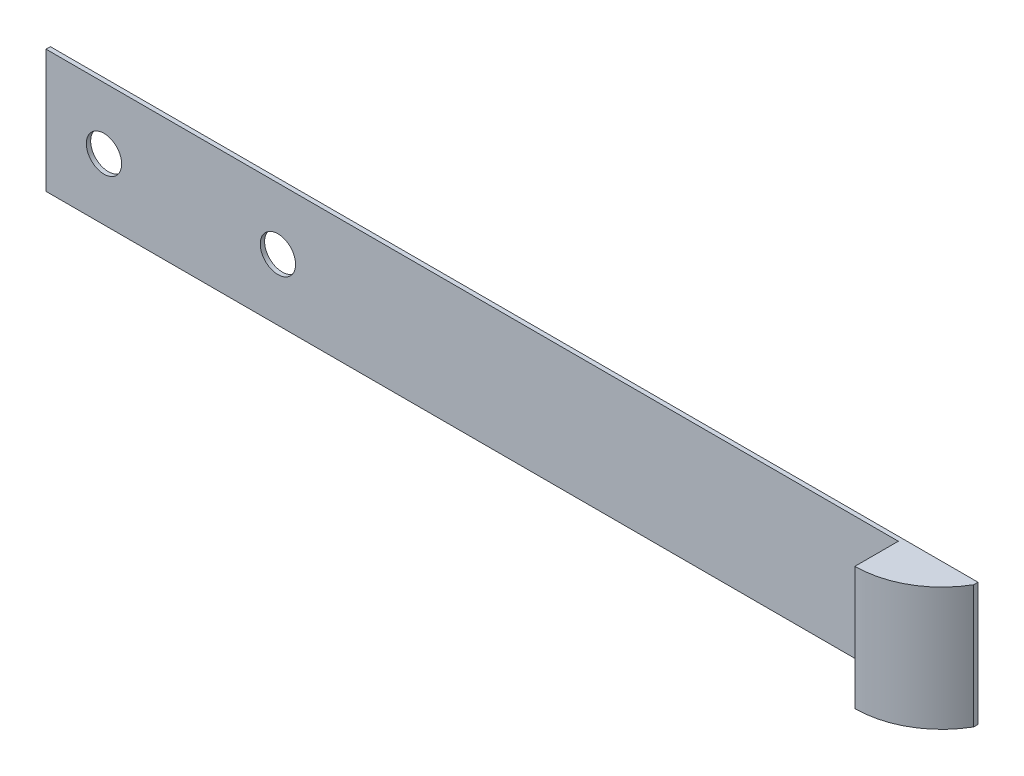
ISO-10303-21;
HEADER;
FILE_DESCRIPTION(('STEP AP214'),'2;1');
FILE_NAME('part.step','',(''),(''),'','','');
FILE_SCHEMA(('AUTOMOTIVE_DESIGN { 1 0 10303 214 1 1 1 1 }'));
ENDSEC;
DATA;
#1=APPLICATION_CONTEXT('core data for automotive mechanical design processes');
#2=APPLICATION_PROTOCOL_DEFINITION('international standard','automotive_design',2000,#1);
#3=PRODUCT_CONTEXT('',#1,'mechanical');
#4=PRODUCT('Part','Part','',(#3));
#5=PRODUCT_RELATED_PRODUCT_CATEGORY('part','',(#4));
#6=PRODUCT_DEFINITION_FORMATION('','',#4);
#7=PRODUCT_DEFINITION_CONTEXT('part definition',#1,'design');
#8=PRODUCT_DEFINITION('design','',#6,#7);
#9=PRODUCT_DEFINITION_SHAPE('','',#8);
#10=(LENGTH_UNIT() NAMED_UNIT(*) SI_UNIT(.MILLI.,.METRE.));
#11=(NAMED_UNIT(*) PLANE_ANGLE_UNIT() SI_UNIT($,.RADIAN.));
#12=(NAMED_UNIT(*) SI_UNIT($,.STERADIAN.) SOLID_ANGLE_UNIT());
#13=UNCERTAINTY_MEASURE_WITH_UNIT(LENGTH_MEASURE(1.E-05),#10,'distance_accuracy_value','');
#14=(GEOMETRIC_REPRESENTATION_CONTEXT(3) GLOBAL_UNCERTAINTY_ASSIGNED_CONTEXT((#13)) GLOBAL_UNIT_ASSIGNED_CONTEXT((#10,
#11,#12)) REPRESENTATION_CONTEXT('',''));
#15=CARTESIAN_POINT('',(0.,0.,0.));
#16=DIRECTION('',(0.,0.,1.));
#17=DIRECTION('',(1.,0.,0.));
#18=AXIS2_PLACEMENT_3D('',#15,#16,#17);
#19=CARTESIAN_POINT('',(-16.,4.25,0.300000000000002));
#20=DIRECTION('',(1.,0.,0.));
#21=DIRECTION('',(0.,0.,-1.));
#22=AXIS2_PLACEMENT_3D('',#19,#20,#21);
#23=PLANE('',#22);
#24=DIRECTION('',(0.,-1.,0.));
#25=VECTOR('',#24,1.);
#26=CARTESIAN_POINT('',(-16.,4.25,0.));
#27=LINE('',#26,#25);
#28=CARTESIAN_POINT('',(-16.,4.25,0.));
#29=VERTEX_POINT('',#28);
#30=CARTESIAN_POINT('',(-16.,-4.25,0.));
#31=VERTEX_POINT('',#30);
#32=EDGE_CURVE('E112',#29,#31,#27,.T.);
#33=ORIENTED_EDGE('',*,*,#32,.T.);
#34=DIRECTION('',(0.,0.,-1.));
#35=VECTOR('',#34,1.);
#36=CARTESIAN_POINT('',(-16.,-4.25,0.299999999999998));
#37=LINE('',#36,#35);
#38=CARTESIAN_POINT('',(-16.,-4.25,0.299999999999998));
#39=VERTEX_POINT('',#38);
#40=EDGE_CURVE('E11',#39,#31,#37,.T.);
#41=ORIENTED_EDGE('',*,*,#40,.F.);
#42=DIRECTION('',(0.,-1.,0.));
#43=VECTOR('',#42,1.);
#44=CARTESIAN_POINT('',(-16.,4.25,0.300000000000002));
#45=LINE('',#44,#43);
#46=CARTESIAN_POINT('',(-16.,4.25,0.300000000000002));
#47=VERTEX_POINT('',#46);
#48=EDGE_CURVE('E124',#47,#39,#45,.T.);
#49=ORIENTED_EDGE('',*,*,#48,.F.);
#50=DIRECTION('',(0.,0.,-1.));
#51=VECTOR('',#50,1.);
#52=CARTESIAN_POINT('',(-16.,4.25,0.300000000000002));
#53=LINE('',#52,#51);
#54=EDGE_CURVE('E133',#47,#29,#53,.T.);
#55=ORIENTED_EDGE('',*,*,#54,.T.);
#56=EDGE_LOOP('',(#33,#41,#49,#55));
#57=FACE_BOUND('',#56,.T.);
#58=ADVANCED_FACE('F30',(#57),#23,.F.);
#59=CARTESIAN_POINT('',(-16.,-4.25,0.299999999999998));
#60=DIRECTION('',(0.,1.,0.));
#61=DIRECTION('',(0.,0.,1.));
#62=AXIS2_PLACEMENT_3D('',#59,#60,#61);
#63=PLANE('',#62);
#64=DIRECTION('',(1.,0.,0.));
#65=VECTOR('',#64,1.);
#66=CARTESIAN_POINT('',(-16.,-4.25,0.));
#67=LINE('',#66,#65);
#68=CARTESIAN_POINT('',(48.,-4.25,0.));
#69=VERTEX_POINT('',#68);
#70=EDGE_CURVE('E116',#31,#69,#67,.T.);
#71=ORIENTED_EDGE('',*,*,#70,.T.);
#72=DIRECTION('',(0.,0.,-1.));
#73=VECTOR('',#72,1.);
#74=CARTESIAN_POINT('',(48.,-4.25,0.299999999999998));
#75=LINE('',#74,#73);
#76=CARTESIAN_POINT('',(48.,-4.25,0.299999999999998));
#77=VERTEX_POINT('',#76);
#78=EDGE_CURVE('E38',#77,#69,#75,.T.);
#79=ORIENTED_EDGE('',*,*,#78,.F.);
#80=CARTESIAN_POINT('',(42.8038475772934,-4.25,-2.7));
#81=DIRECTION('',(0.,-1.,0.));
#82=DIRECTION('',(-1.,0.,0.));
#83=AXIS2_PLACEMENT_3D('',#80,#81,#82);
#84=CIRCLE('',#83,6.);
#85=CARTESIAN_POINT('',(42.8038475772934,-4.25,3.3));
#86=VERTEX_POINT('',#85);
#87=EDGE_CURVE('E88',#77,#86,#84,.T.);
#88=ORIENTED_EDGE('',*,*,#87,.T.);
#89=DIRECTION('',(0.,0.,-1.));
#90=VECTOR('',#89,1.);
#91=CARTESIAN_POINT('',(42.8038475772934,-4.25,3.3));
#92=LINE('',#91,#90);
#93=CARTESIAN_POINT('',(42.8038475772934,-4.25,0.299999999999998));
#94=VERTEX_POINT('',#93);
#95=EDGE_CURVE('E94',#86,#94,#92,.T.);
#96=ORIENTED_EDGE('',*,*,#95,.T.);
#97=DIRECTION('',(1.,0.,0.));
#98=VECTOR('',#97,1.);
#99=CARTESIAN_POINT('',(-16.,-4.25,0.299999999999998));
#100=LINE('',#99,#98);
#101=EDGE_CURVE('E126',#39,#94,#100,.T.);
#102=ORIENTED_EDGE('',*,*,#101,.F.);
#103=ORIENTED_EDGE('',*,*,#40,.T.);
#104=EDGE_LOOP('',(#71,#79,#88,#96,#102,#103));
#105=FACE_BOUND('',#104,.T.);
#106=ADVANCED_FACE('F98',(#105),#63,.F.);
#107=CARTESIAN_POINT('',(48.,4.25,0.299999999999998));
#108=DIRECTION('',(-1.,0.,0.));
#109=DIRECTION('',(0.,0.,1.));
#110=AXIS2_PLACEMENT_3D('',#107,#108,#109);
#111=PLANE('',#110);
#112=DIRECTION('',(0.,1.,0.));
#113=VECTOR('',#112,1.);
#114=CARTESIAN_POINT('',(48.,4.25,0.));
#115=LINE('',#114,#113);
#116=CARTESIAN_POINT('',(48.,4.25,0.));
#117=VERTEX_POINT('',#116);
#118=EDGE_CURVE('E120',#69,#117,#115,.T.);
#119=ORIENTED_EDGE('',*,*,#118,.T.);
#120=DIRECTION('',(0.,0.,-1.));
#121=VECTOR('',#120,1.);
#122=CARTESIAN_POINT('',(48.,4.25,0.299999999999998));
#123=LINE('',#122,#121);
#124=CARTESIAN_POINT('',(48.,4.25,0.299999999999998));
#125=VERTEX_POINT('',#124);
#126=EDGE_CURVE('E138',#125,#117,#123,.T.);
#127=ORIENTED_EDGE('',*,*,#126,.F.);
#128=DIRECTION('',(0.,1.,0.));
#129=VECTOR('',#128,1.);
#130=CARTESIAN_POINT('',(48.,4.25,0.299999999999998));
#131=LINE('',#130,#129);
#132=EDGE_CURVE('E129',#77,#125,#131,.T.);
#133=ORIENTED_EDGE('',*,*,#132,.F.);
#134=ORIENTED_EDGE('',*,*,#78,.T.);
#135=EDGE_LOOP('',(#119,#127,#133,#134));
#136=FACE_BOUND('',#135,.T.);
#137=ADVANCED_FACE('F141',(#136),#111,.F.);
#138=CARTESIAN_POINT('',(-16.,4.25,0.300000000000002));
#139=DIRECTION('',(0.,-1.,0.));
#140=DIRECTION('',(0.,0.,-1.));
#141=AXIS2_PLACEMENT_3D('',#138,#139,#140);
#142=PLANE('',#141);
#143=DIRECTION('',(-1.,0.,0.));
#144=VECTOR('',#143,1.);
#145=CARTESIAN_POINT('',(-16.,4.25,0.));
#146=LINE('',#145,#144);
#147=EDGE_CURVE('E122',#117,#29,#146,.T.);
#148=ORIENTED_EDGE('',*,*,#147,.T.);
#149=ORIENTED_EDGE('',*,*,#54,.F.);
#150=DIRECTION('',(-1.,0.,0.));
#151=VECTOR('',#150,1.);
#152=CARTESIAN_POINT('',(-16.,4.25,0.300000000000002));
#153=LINE('',#152,#151);
#154=CARTESIAN_POINT('',(42.8038475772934,4.25,0.300000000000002));
#155=VERTEX_POINT('',#154);
#156=EDGE_CURVE('E50',#155,#47,#153,.T.);
#157=ORIENTED_EDGE('',*,*,#156,.F.);
#158=DIRECTION('',(0.,0.,1.));
#159=VECTOR('',#158,1.);
#160=CARTESIAN_POINT('',(42.8038475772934,4.25,3.3));
#161=LINE('',#160,#159);
#162=CARTESIAN_POINT('',(42.8038475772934,4.25,3.3));
#163=VERTEX_POINT('',#162);
#164=EDGE_CURVE('E110',#155,#163,#161,.T.);
#165=ORIENTED_EDGE('',*,*,#164,.T.);
#166=CARTESIAN_POINT('',(42.8038475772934,4.25,-2.7));
#167=DIRECTION('',(0.,-1.,0.));
#168=DIRECTION('',(0.,0.,-1.));
#169=AXIS2_PLACEMENT_3D('',#166,#167,#168);
#170=CIRCLE('',#169,6.);
#171=EDGE_CURVE('E90',#163,#125,#170,.F.);
#172=ORIENTED_EDGE('',*,*,#171,.T.);
#173=ORIENTED_EDGE('',*,*,#126,.T.);
#174=EDGE_LOOP('',(#148,#149,#157,#165,#172,#173));
#175=FACE_BOUND('',#174,.T.);
#176=ADVANCED_FACE('F146',(#175),#142,.F.);
#177=CARTESIAN_POINT('',(-16.,-4.25,0.299999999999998));
#178=DIRECTION('',(0.,0.,1.));
#179=DIRECTION('',(1.,0.,0.));
#180=AXIS2_PLACEMENT_3D('',#177,#178,#179);
#181=PLANE('',#180);
#182=CARTESIAN_POINT('',(-12.,0.,0.299999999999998));
#183=DIRECTION('',(0.,0.,1.));
#184=DIRECTION('',(1.,0.,0.));
#185=AXIS2_PLACEMENT_3D('',#182,#183,#184);
#186=CIRCLE('',#185,1.2192);
#187=CARTESIAN_POINT('',(-10.7808,0.,0.299999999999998));
#188=VERTEX_POINT('',#187);
#189=EDGE_CURVE('E203',#188,#188,#186,.T.);
#190=ORIENTED_EDGE('',*,*,#189,.F.);
#191=EDGE_LOOP('',(#190));
#192=FACE_BOUND('',#191,.T.);
#193=CARTESIAN_POINT('',(0.,0.,0.300000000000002));
#194=DIRECTION('',(0.,0.,1.));
#195=DIRECTION('',(1.,0.,0.));
#196=AXIS2_PLACEMENT_3D('',#193,#194,#195);
#197=CIRCLE('',#196,1.2192);
#198=CARTESIAN_POINT('',(1.2192,0.,0.300000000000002));
#199=VERTEX_POINT('',#198);
#200=EDGE_CURVE('E101',#199,#199,#197,.T.);
#201=ORIENTED_EDGE('',*,*,#200,.F.);
#202=EDGE_LOOP('',(#201));
#203=FACE_BOUND('',#202,.T.);
#204=DIRECTION('',(0.,-1.,0.));
#205=VECTOR('',#204,1.);
#206=CARTESIAN_POINT('',(42.8038475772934,10.25,0.300000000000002));
#207=LINE('',#206,#205);
#208=EDGE_CURVE('E46',#155,#94,#207,.T.);
#209=ORIENTED_EDGE('',*,*,#208,.F.);
#210=ORIENTED_EDGE('',*,*,#156,.T.);
#211=ORIENTED_EDGE('',*,*,#48,.T.);
#212=ORIENTED_EDGE('',*,*,#101,.T.);
#213=EDGE_LOOP('',(#209,#210,#211,#212));
#214=FACE_BOUND('',#213,.T.);
#215=ADVANCED_FACE('F150',(#192,#203,#214),#181,.T.);
#216=CARTESIAN_POINT('',(-16.,-4.25,0.));
#217=DIRECTION('',(0.,0.,1.));
#218=DIRECTION('',(1.,0.,0.));
#219=AXIS2_PLACEMENT_3D('',#216,#217,#218);
#220=PLANE('',#219);
#221=CARTESIAN_POINT('',(-12.,0.,0.));
#222=DIRECTION('',(0.,0.,-1.));
#223=DIRECTION('',(-1.,0.,0.));
#224=AXIS2_PLACEMENT_3D('',#221,#222,#223);
#225=CIRCLE('',#224,1.2192);
#226=CARTESIAN_POINT('',(-13.2192,0.,0.));
#227=VERTEX_POINT('',#226);
#228=EDGE_CURVE('E206',#227,#227,#225,.T.);
#229=ORIENTED_EDGE('',*,*,#228,.F.);
#230=EDGE_LOOP('',(#229));
#231=FACE_BOUND('',#230,.T.);
#232=CARTESIAN_POINT('',(0.,0.,0.));
#233=DIRECTION('',(0.,0.,-1.));
#234=DIRECTION('',(-1.,0.,0.));
#235=AXIS2_PLACEMENT_3D('',#232,#233,#234);
#236=CIRCLE('',#235,1.2192);
#237=CARTESIAN_POINT('',(-1.2192,0.,0.));
#238=VERTEX_POINT('',#237);
#239=EDGE_CURVE('E208',#238,#238,#236,.T.);
#240=ORIENTED_EDGE('',*,*,#239,.F.);
#241=EDGE_LOOP('',(#240));
#242=FACE_BOUND('',#241,.T.);
#243=ORIENTED_EDGE('',*,*,#32,.F.);
#244=ORIENTED_EDGE('',*,*,#147,.F.);
#245=ORIENTED_EDGE('',*,*,#118,.F.);
#246=ORIENTED_EDGE('',*,*,#70,.F.);
#247=EDGE_LOOP('',(#243,#244,#245,#246));
#248=FACE_BOUND('',#247,.T.);
#249=ADVANCED_FACE('F145',(#231,#242,#248),#220,.F.);
#250=CARTESIAN_POINT('',(42.8038475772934,10.25,3.3));
#251=DIRECTION('',(-1.,0.,0.));
#252=DIRECTION('',(0.,0.,1.));
#253=AXIS2_PLACEMENT_3D('',#250,#251,#252);
#254=PLANE('',#253);
#255=ORIENTED_EDGE('',*,*,#164,.F.);
#256=ORIENTED_EDGE('',*,*,#208,.T.);
#257=ORIENTED_EDGE('',*,*,#95,.F.);
#258=DIRECTION('',(0.,-1.,0.));
#259=VECTOR('',#258,1.);
#260=CARTESIAN_POINT('',(42.8038475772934,10.25,3.3));
#261=LINE('',#260,#259);
#262=EDGE_CURVE('E84',#163,#86,#261,.T.);
#263=ORIENTED_EDGE('',*,*,#262,.F.);
#264=EDGE_LOOP('',(#255,#256,#257,#263));
#265=FACE_BOUND('',#264,.T.);
#266=ADVANCED_FACE('F103',(#265),#254,.T.);
#267=CARTESIAN_POINT('',(42.8038475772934,10.25,-2.7));
#268=DIRECTION('',(0.,-1.,0.));
#269=DIRECTION('',(1.,0.,0.));
#270=AXIS2_PLACEMENT_3D('',#267,#268,#269);
#271=CYLINDRICAL_SURFACE('',#270,6.);
#272=ORIENTED_EDGE('',*,*,#171,.F.);
#273=ORIENTED_EDGE('',*,*,#262,.T.);
#274=ORIENTED_EDGE('',*,*,#87,.F.);
#275=ORIENTED_EDGE('',*,*,#132,.T.);
#276=EDGE_LOOP('',(#272,#273,#274,#275));
#277=FACE_BOUND('',#276,.T.);
#278=ADVANCED_FACE('F86',(#277),#271,.T.);
#279=CARTESIAN_POINT('',(0.,0.,0.));
#280=DIRECTION('',(0.,0.,-1.));
#281=DIRECTION('',(-1.,0.,0.));
#282=AXIS2_PLACEMENT_3D('',#279,#280,#281);
#283=CYLINDRICAL_SURFACE('',#282,1.2192);
#284=ORIENTED_EDGE('',*,*,#200,.T.);
#285=EDGE_LOOP('',(#284));
#286=FACE_BOUND('',#285,.T.);
#287=ORIENTED_EDGE('',*,*,#239,.T.);
#288=EDGE_LOOP('',(#287));
#289=FACE_BOUND('',#288,.T.);
#290=ADVANCED_FACE('F189',(#286,#289),#283,.F.);
#291=CARTESIAN_POINT('',(-12.,0.,0.));
#292=DIRECTION('',(0.,0.,-1.));
#293=DIRECTION('',(-1.,0.,0.));
#294=AXIS2_PLACEMENT_3D('',#291,#292,#293);
#295=CYLINDRICAL_SURFACE('',#294,1.2192);
#296=ORIENTED_EDGE('',*,*,#189,.T.);
#297=EDGE_LOOP('',(#296));
#298=FACE_BOUND('',#297,.T.);
#299=ORIENTED_EDGE('',*,*,#228,.T.);
#300=EDGE_LOOP('',(#299));
#301=FACE_BOUND('',#300,.T.);
#302=ADVANCED_FACE('F194',(#298,#301),#295,.F.);
#303=CLOSED_SHELL('',(#58,#106,#137,#176,#215,#249,#266,#278,#290,#302));
#304=MANIFOLD_SOLID_BREP('B2',#303);
#305=ADVANCED_BREP_SHAPE_REPRESENTATION('',(#18,#304),#14);
#306=SHAPE_DEFINITION_REPRESENTATION(#9,#305);
ENDSEC;
END-ISO-10303-21;
